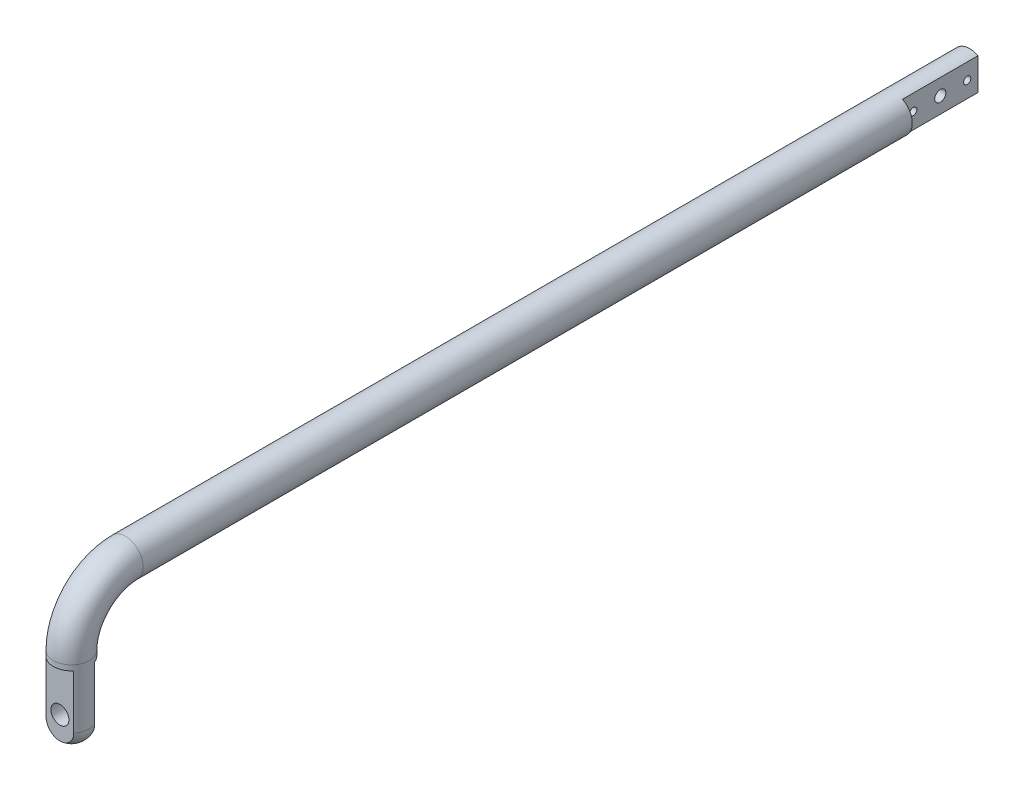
ISO-10303-21;
HEADER;
FILE_DESCRIPTION(('STEP AP214'),'2;1');
FILE_NAME('part.step','',(''),(''),'','','');
FILE_SCHEMA(('AUTOMOTIVE_DESIGN { 1 0 10303 214 1 1 1 1 }'));
ENDSEC;
DATA;
#1=APPLICATION_CONTEXT('core data for automotive mechanical design processes');
#2=APPLICATION_PROTOCOL_DEFINITION('international standard','automotive_design',2000,#1);
#3=PRODUCT_CONTEXT('',#1,'mechanical');
#4=PRODUCT('Part','Part','',(#3));
#5=PRODUCT_RELATED_PRODUCT_CATEGORY('part','',(#4));
#6=PRODUCT_DEFINITION_FORMATION('','',#4);
#7=PRODUCT_DEFINITION_CONTEXT('part definition',#1,'design');
#8=PRODUCT_DEFINITION('design','',#6,#7);
#9=PRODUCT_DEFINITION_SHAPE('','',#8);
#10=(LENGTH_UNIT() NAMED_UNIT(*) SI_UNIT(.MILLI.,.METRE.));
#11=(NAMED_UNIT(*) PLANE_ANGLE_UNIT() SI_UNIT($,.RADIAN.));
#12=(NAMED_UNIT(*) SI_UNIT($,.STERADIAN.) SOLID_ANGLE_UNIT());
#13=UNCERTAINTY_MEASURE_WITH_UNIT(LENGTH_MEASURE(1.E-05),#10,'distance_accuracy_value','');
#14=(GEOMETRIC_REPRESENTATION_CONTEXT(3) GLOBAL_UNCERTAINTY_ASSIGNED_CONTEXT((#13)) GLOBAL_UNIT_ASSIGNED_CONTEXT((#10,
#11,#12)) REPRESENTATION_CONTEXT('',''));
#15=CARTESIAN_POINT('',(0.,0.,0.));
#16=DIRECTION('',(0.,0.,1.));
#17=DIRECTION('',(1.,0.,0.));
#18=AXIS2_PLACEMENT_3D('',#15,#16,#17);
#19=CARTESIAN_POINT('',(0.,-15.0000000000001,250.));
#20=DIRECTION('',(0.,-1.,0.));
#21=DIRECTION('',(0.,0.,-1.));
#22=AXIS2_PLACEMENT_3D('',#19,#20,#21);
#23=CYLINDRICAL_SURFACE('',#22,5.);
#24=DIRECTION('',(0.,-1.,0.));
#25=VECTOR('',#24,1.);
#26=CARTESIAN_POINT('',(3.8418745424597,-15.0000000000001,253.2));
#27=LINE('',#26,#25);
#28=CARTESIAN_POINT('',(3.8418745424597,-31.44,253.2));
#29=VERTEX_POINT('',#28);
#30=CARTESIAN_POINT('',(3.8418745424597,-16.44,253.2));
#31=VERTEX_POINT('',#30);
#32=EDGE_CURVE('E88',#29,#31,#27,.F.);
#33=ORIENTED_EDGE('',*,*,#32,.F.);
#34=CARTESIAN_POINT('',(0.,-31.44,250.));
#35=DIRECTION('',(0.,-1.,0.));
#36=DIRECTION('',(0.,0.,-1.));
#37=AXIS2_PLACEMENT_3D('',#34,#35,#36);
#38=CIRCLE('',#37,5.);
#39=CARTESIAN_POINT('',(4.66476151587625,-31.44,248.2));
#40=VERTEX_POINT('',#39);
#41=EDGE_CURVE('E53',#29,#40,#38,.F.);
#42=ORIENTED_EDGE('',*,*,#41,.T.);
#43=DIRECTION('',(0.,-1.,0.));
#44=VECTOR('',#43,1.);
#45=CARTESIAN_POINT('',(4.66476151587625,-15.0000000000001,248.2));
#46=LINE('',#45,#44);
#47=CARTESIAN_POINT('',(4.66476151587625,-16.44,248.2));
#48=VERTEX_POINT('',#47);
#49=EDGE_CURVE('E103',#48,#40,#46,.T.);
#50=ORIENTED_EDGE('',*,*,#49,.F.);
#51=CARTESIAN_POINT('',(0.,-16.44,250.));
#52=DIRECTION('',(0.,1.,0.));
#53=DIRECTION('',(0.,0.,1.));
#54=AXIS2_PLACEMENT_3D('',#51,#52,#53);
#55=CIRCLE('',#54,5.);
#56=CARTESIAN_POINT('',(-4.66476151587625,-16.44,248.2));
#57=VERTEX_POINT('',#56);
#58=EDGE_CURVE('E219',#57,#48,#55,.F.);
#59=ORIENTED_EDGE('',*,*,#58,.F.);
#60=DIRECTION('',(0.,-1.,0.));
#61=VECTOR('',#60,1.);
#62=CARTESIAN_POINT('',(-4.66476151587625,-15.0000000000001,248.2));
#63=LINE('',#62,#61);
#64=CARTESIAN_POINT('',(-4.66476151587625,-31.44,248.2));
#65=VERTEX_POINT('',#64);
#66=EDGE_CURVE('E105',#65,#57,#63,.F.);
#67=ORIENTED_EDGE('',*,*,#66,.F.);
#68=CARTESIAN_POINT('',(-3.8418745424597,-31.44,253.2));
#69=VERTEX_POINT('',#68);
#70=EDGE_CURVE('E95',#65,#69,#38,.F.);
#71=ORIENTED_EDGE('',*,*,#70,.T.);
#72=DIRECTION('',(0.,-1.,0.));
#73=VECTOR('',#72,1.);
#74=CARTESIAN_POINT('',(-3.8418745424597,-15.0000000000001,253.2));
#75=LINE('',#74,#73);
#76=CARTESIAN_POINT('',(-3.8418745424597,-16.44,253.2));
#77=VERTEX_POINT('',#76);
#78=EDGE_CURVE('E45',#77,#69,#75,.T.);
#79=ORIENTED_EDGE('',*,*,#78,.F.);
#80=CARTESIAN_POINT('',(0.,-16.44,250.));
#81=DIRECTION('',(0.,1.,0.));
#82=DIRECTION('',(0.,0.,1.));
#83=AXIS2_PLACEMENT_3D('',#80,#81,#82);
#84=CIRCLE('',#83,5.);
#85=EDGE_CURVE('E11',#31,#77,#84,.F.);
#86=ORIENTED_EDGE('',*,*,#85,.F.);
#87=EDGE_LOOP('',(#33,#42,#50,#59,#67,#71,#79,#86));
#88=FACE_BOUND('',#87,.T.);
#89=CARTESIAN_POINT('',(0.,-15.0000000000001,250.));
#90=DIRECTION('',(0.,-1.,0.));
#91=DIRECTION('',(1.,0.,0.));
#92=AXIS2_PLACEMENT_3D('',#89,#90,#91);
#93=CIRCLE('',#92,5.);
#94=CARTESIAN_POINT('',(0.,-15.0000000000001,255.));
#95=VERTEX_POINT('',#94);
#96=EDGE_CURVE('E226',#95,#95,#93,.T.);
#97=ORIENTED_EDGE('',*,*,#96,.T.);
#98=EDGE_LOOP('',(#97));
#99=FACE_BOUND('',#98,.T.);
#100=ADVANCED_FACE('F31',(#88,#99),#23,.T.);
#101=CARTESIAN_POINT('',(0.,-15.,235.));
#102=DIRECTION('',(1.,0.,0.));
#103=DIRECTION('',(0.,0.,-1.));
#104=AXIS2_PLACEMENT_3D('',#101,#102,#103);
#105=TOROIDAL_SURFACE('',#104,15.,5.);
#106=CARTESIAN_POINT('',(0.,0.,235.));
#107=DIRECTION('',(0.,0.,1.));
#108=DIRECTION('',(1.,0.,0.));
#109=AXIS2_PLACEMENT_3D('',#106,#107,#108);
#110=CIRCLE('',#109,5.);
#111=CARTESIAN_POINT('',(0.,5.,235.));
#112=VERTEX_POINT('',#111);
#113=EDGE_CURVE('E228',#112,#112,#110,.T.);
#114=CARTESIAN_POINT('',(0.,-15.,235.));
#115=DIRECTION('',(1.,0.,0.));
#116=DIRECTION('',(0.,0.,-1.));
#117=AXIS2_PLACEMENT_3D('',#114,#115,#116);
#118=CIRCLE('',#117,20.);
#119=EDGE_CURVE('',#112,#95,#118,.T.);
#120=ORIENTED_EDGE('',*,*,#113,.T.);
#121=ORIENTED_EDGE('',*,*,#96,.F.);
#122=ORIENTED_EDGE('',*,*,#119,.T.);
#123=ORIENTED_EDGE('',*,*,#119,.F.);
#124=EDGE_LOOP('',(#120,#122,#121,#123));
#125=FACE_BOUND('',#124,.T.);
#126=ADVANCED_FACE('F174',(#125),#105,.T.);
#127=CARTESIAN_POINT('',(0.,0.,235.));
#128=DIRECTION('',(0.,0.,-1.));
#129=DIRECTION('',(-1.,0.,0.));
#130=AXIS2_PLACEMENT_3D('',#127,#128,#129);
#131=CYLINDRICAL_SURFACE('',#130,5.);
#132=CARTESIAN_POINT('',(-5.,0.,8.95));
#133=CARTESIAN_POINT('',(-4.99999951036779,-0.0848984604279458,8.9500006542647));
#134=CARTESIAN_POINT('',(-4.99781721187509,-0.16980366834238,8.95699825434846));
#135=CARTESIAN_POINT('',(-4.98932527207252,-0.337133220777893,8.98473181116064));
#136=CARTESIAN_POINT('',(-4.98301463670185,-0.419556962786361,9.00547107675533));
#137=CARTESIAN_POINT('',(-4.96695583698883,-0.579486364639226,9.05992291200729));
#138=CARTESIAN_POINT('',(-4.95721294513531,-0.656999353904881,9.09361559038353));
#139=CARTESIAN_POINT('',(-4.93529695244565,-0.805275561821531,9.17293382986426));
#140=CARTESIAN_POINT('',(-4.923123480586,-0.876037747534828,9.2185612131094));
#141=CARTESIAN_POINT('',(-4.89722526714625,-1.01095832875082,9.32191625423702));
#142=CARTESIAN_POINT('',(-4.88346713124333,-1.07488231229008,9.37994151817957));
#143=CARTESIAN_POINT('',(-4.85614480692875,-1.19226552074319,9.50581140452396));
#144=CARTESIAN_POINT('',(-4.84258065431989,-1.24572283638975,9.57365781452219));
#145=CARTESIAN_POINT('',(-4.81682477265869,-1.34191867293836,9.71926408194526));
#146=CARTESIAN_POINT('',(-4.8046743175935,-1.38436572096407,9.7972244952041));
#147=CARTESIAN_POINT('',(-4.78362317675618,-1.45544961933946,9.95961468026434));
#148=CARTESIAN_POINT('',(-4.77472165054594,-1.48409004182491,10.0440427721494));
#149=CARTESIAN_POINT('',(-4.76152527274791,-1.52589247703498,10.2143291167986));
#150=CARTESIAN_POINT('',(-4.75710149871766,-1.53948878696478,10.3000704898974));
#151=CARTESIAN_POINT('',(-4.75297857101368,-1.55217372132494,10.4727226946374));
#152=CARTESIAN_POINT('',(-4.75327818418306,-1.55126613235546,10.5596332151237));
#153=CARTESIAN_POINT('',(-4.75845428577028,-1.53530900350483,10.7285765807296));
#154=CARTESIAN_POINT('',(-4.76315261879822,-1.52080991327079,10.8106677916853));
#155=CARTESIAN_POINT('',(-4.77630760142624,-1.47897319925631,10.9711897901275));
#156=CARTESIAN_POINT('',(-4.78476464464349,-1.45163423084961,11.0496201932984));
#157=CARTESIAN_POINT('',(-4.80462183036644,-1.38450171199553,11.2019126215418));
#158=CARTESIAN_POINT('',(-4.81606267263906,-1.34453416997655,11.2756924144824));
#159=CARTESIAN_POINT('',(-4.84057952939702,-1.25339989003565,11.4156794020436));
#160=CARTESIAN_POINT('',(-4.85365596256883,-1.2022302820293,11.4818846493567));
#161=CARTESIAN_POINT('',(-4.88068691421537,-1.08743667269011,11.6079572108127));
#162=CARTESIAN_POINT('',(-4.89465453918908,-1.0233577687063,11.6674082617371));
#163=CARTESIAN_POINT('',(-4.92137742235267,-0.885965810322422,11.7748209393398));
#164=CARTESIAN_POINT('',(-4.93413259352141,-0.812652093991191,11.8227817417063));
#165=CARTESIAN_POINT('',(-4.95712370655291,-0.658078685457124,11.9061285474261));
#166=CARTESIAN_POINT('',(-4.96733986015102,-0.576763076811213,11.9414166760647));
#167=CARTESIAN_POINT('',(-4.98395906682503,-0.408959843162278,11.9976903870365));
#168=CARTESIAN_POINT('',(-4.99036325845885,-0.322473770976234,12.0186802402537));
#169=CARTESIAN_POINT('',(-4.99845438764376,-0.150319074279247,12.0450557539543));
#170=CARTESIAN_POINT('',(-5.00031163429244,-0.0647446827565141,12.0510050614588));
#171=CARTESIAN_POINT('',(-4.99960248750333,0.106188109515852,12.048717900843));
#172=CARTESIAN_POINT('',(-4.99703672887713,0.191546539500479,12.0404834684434));
#173=CARTESIAN_POINT('',(-4.98788169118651,0.35745979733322,12.0105157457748));
#174=CARTESIAN_POINT('',(-4.9813920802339,0.438081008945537,11.989116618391));
#175=CARTESIAN_POINT('',(-4.965146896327,0.594567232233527,11.9338335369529));
#176=CARTESIAN_POINT('',(-4.95539092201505,0.670431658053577,11.8999480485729));
#177=CARTESIAN_POINT('',(-4.93332471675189,0.817286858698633,11.8197389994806));
#178=CARTESIAN_POINT('',(-4.92095852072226,0.888115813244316,11.7731349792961));
#179=CARTESIAN_POINT('',(-4.89508710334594,1.02113752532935,11.669149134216));
#180=CARTESIAN_POINT('',(-4.88158157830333,1.08332796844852,11.6117644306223));
#181=CARTESIAN_POINT('',(-4.85429209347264,1.19982105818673,11.4851955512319));
#182=CARTESIAN_POINT('',(-4.84051777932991,1.25372210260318,11.4156388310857));
#183=CARTESIAN_POINT('',(-4.8148023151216,1.34912131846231,11.2681682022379));
#184=CARTESIAN_POINT('',(-4.80286113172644,1.39061971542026,11.190254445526));
#185=CARTESIAN_POINT('',(-4.78229760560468,1.45977182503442,11.0284613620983));
#186=CARTESIAN_POINT('',(-4.77366186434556,1.48748156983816,10.9446077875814));
#187=CARTESIAN_POINT('',(-4.76075522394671,1.52829209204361,10.7731033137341));
#188=CARTESIAN_POINT('',(-4.75648269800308,1.54139831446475,10.6854538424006));
#189=CARTESIAN_POINT('',(-4.75295389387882,1.55224290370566,10.5130385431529));
#190=CARTESIAN_POINT('',(-4.75348283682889,1.55063923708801,10.4283179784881));
#191=CARTESIAN_POINT('',(-4.75897670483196,1.53369431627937,10.2604160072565));
#192=CARTESIAN_POINT('',(-4.76394142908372,1.51835368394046,10.1772345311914));
#193=CARTESIAN_POINT('',(-4.77759858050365,1.47480761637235,10.015927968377));
#194=CARTESIAN_POINT('',(-4.78623717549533,1.4467876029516,9.93774792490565));
#195=CARTESIAN_POINT('',(-4.80625573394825,1.37882379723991,9.78713630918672));
#196=CARTESIAN_POINT('',(-4.81763624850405,1.33887760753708,9.71470589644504));
#197=CARTESIAN_POINT('',(-4.84240420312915,1.24639244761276,9.57462498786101));
#198=CARTESIAN_POINT('',(-4.85585213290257,1.1934270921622,9.5072667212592));
#199=CARTESIAN_POINT('',(-4.88295838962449,1.07716085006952,9.38218112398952));
#200=CARTESIAN_POINT('',(-4.89661677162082,1.01385721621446,9.32445636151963));
#201=CARTESIAN_POINT('',(-4.92312838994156,0.876277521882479,9.21843192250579));
#202=CARTESIAN_POINT('',(-4.93594196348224,0.80171552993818,9.17049227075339));
#203=CARTESIAN_POINT('',(-4.9588270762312,0.645193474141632,9.08789244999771));
#204=CARTESIAN_POINT('',(-4.96889973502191,0.563236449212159,9.05322685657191));
#205=CARTESIAN_POINT('',(-4.98442975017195,0.401796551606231,9.00079732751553));
#206=CARTESIAN_POINT('',(-4.99021839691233,0.32274401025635,8.98180253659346));
#207=CARTESIAN_POINT('',(-4.99800338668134,0.162462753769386,8.9564047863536));
#208=CARTESIAN_POINT('',(-5.00000046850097,0.0812344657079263,8.94999937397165));
#209=CARTESIAN_POINT('',(-5.,0.,8.95));
#210=B_SPLINE_CURVE_WITH_KNOTS('',3,(#132,#133,#134,#135,#136,#137,#138,#139,#140,#141,#142,
#143,#144,#145,#146,#147,#148,#149,#150,#151,#152,#153,#154,#155,#156,#157,#158,#159,#160,#161,
#162,#163,#164,#165,#166,#167,#168,#169,#170,#171,#172,#173,#174,#175,#176,#177,#178,#179,#180,
#181,#182,#183,#184,#185,#186,#187,#188,#189,#190,#191,#192,#193,#194,#195,#196,#197,#198,#199,
#200,#201,#202,#203,#204,#205,#206,#207,#208,#209),.UNSPECIFIED.,.T.,.F.,(4,2,2,2,2,2,2,2,2,2,2,
2,2,2,2,2,2,2,2,2,2,2,2,2,2,2,2,2,2,2,2,2,2,2,2,2,2,2,4),(0.,0.254396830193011,
0.508854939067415,0.76292385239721,1.01703157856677,1.27811016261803,1.53923632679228,
1.80669687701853,2.07408819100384,2.33354085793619,2.59292578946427,2.84223973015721,
3.09157978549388,3.34451706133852,3.59751921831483,3.86184447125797,4.12618868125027,
4.39253268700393,4.65879710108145,4.91492451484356,5.17101517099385,5.42085927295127,
5.67073408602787,5.92663973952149,6.18261382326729,6.44855856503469,6.71449847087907,
6.97934868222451,7.24410010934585,7.49706915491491,7.75002674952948,7.99939903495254,
8.248821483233,8.5078669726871,8.76698141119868,9.03437391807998,9.30165703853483,
9.54512221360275,9.78853994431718),.UNSPECIFIED.);
#211=CARTESIAN_POINT('',(-5.,0.,8.95));
#212=VERTEX_POINT('',#211);
#213=EDGE_CURVE('E123',#212,#212,#210,.T.);
#214=ORIENTED_EDGE('',*,*,#213,.F.);
#215=EDGE_LOOP('',(#214));
#216=FACE_BOUND('',#215,.T.);
#217=ORIENTED_EDGE('',*,*,#113,.F.);
#218=EDGE_LOOP('',(#217));
#219=FACE_BOUND('',#218,.T.);
#220=CARTESIAN_POINT('',(0.,0.,21.));
#221=DIRECTION('',(0.,0.,1.));
#222=DIRECTION('',(1.,0.,0.));
#223=AXIS2_PLACEMENT_3D('',#220,#221,#222);
#224=CIRCLE('',#223,5.);
#225=CARTESIAN_POINT('',(2.3,-4.43959457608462,21.));
#226=VERTEX_POINT('',#225);
#227=CARTESIAN_POINT('',(2.3,4.43959457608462,21.));
#228=VERTEX_POINT('',#227);
#229=EDGE_CURVE('E207',#226,#228,#224,.T.);
#230=ORIENTED_EDGE('',*,*,#229,.T.);
#231=DIRECTION('',(0.,0.,-1.));
#232=VECTOR('',#231,1.);
#233=CARTESIAN_POINT('',(2.3,4.43959457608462,235.));
#234=LINE('',#233,#232);
#235=CARTESIAN_POINT('',(2.3,4.43959457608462,0.));
#236=VERTEX_POINT('',#235);
#237=EDGE_CURVE('E214',#228,#236,#234,.T.);
#238=ORIENTED_EDGE('',*,*,#237,.T.);
#239=CARTESIAN_POINT('',(0.,0.,0.));
#240=DIRECTION('',(0.,0.,1.));
#241=DIRECTION('',(1.,0.,0.));
#242=AXIS2_PLACEMENT_3D('',#239,#240,#241);
#243=CIRCLE('',#242,5.);
#244=CARTESIAN_POINT('',(2.3,-4.43959457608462,0.));
#245=VERTEX_POINT('',#244);
#246=EDGE_CURVE('E232',#236,#245,#243,.T.);
#247=ORIENTED_EDGE('',*,*,#246,.T.);
#248=DIRECTION('',(0.,0.,-1.));
#249=VECTOR('',#248,1.);
#250=CARTESIAN_POINT('',(2.3,-4.43959457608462,235.));
#251=LINE('',#250,#249);
#252=EDGE_CURVE('E210',#245,#226,#251,.F.);
#253=ORIENTED_EDGE('',*,*,#252,.T.);
#254=EDGE_LOOP('',(#230,#238,#247,#253));
#255=FACE_BOUND('',#254,.T.);
#256=ADVANCED_FACE('F179',(#216,#219,#255),#131,.T.);
#257=CARTESIAN_POINT('',(0.,0.,0.));
#258=DIRECTION('',(0.,0.,1.));
#259=DIRECTION('',(1.,0.,0.));
#260=AXIS2_PLACEMENT_3D('',#257,#258,#259);
#261=PLANE('',#260);
#262=ORIENTED_EDGE('',*,*,#246,.F.);
#263=DIRECTION('',(0.,-1.,0.));
#264=VECTOR('',#263,1.);
#265=CARTESIAN_POINT('',(2.3,0.,0.));
#266=LINE('',#265,#264);
#267=EDGE_CURVE('E217',#236,#245,#266,.T.);
#268=ORIENTED_EDGE('',*,*,#267,.T.);
#269=EDGE_LOOP('',(#262,#268));
#270=FACE_BOUND('',#269,.T.);
#271=ADVANCED_FACE('F185',(#270),#261,.F.);
#272=CARTESIAN_POINT('',(0.,-31.44,250.));
#273=DIRECTION('',(0.,0.,1.));
#274=DIRECTION('',(1.,0.,0.));
#275=AXIS2_PLACEMENT_3D('',#272,#273,#274);
#276=SPHERICAL_SURFACE('',#275,5.);
#277=CARTESIAN_POINT('',(0.,-31.44,253.2));
#278=DIRECTION('',(0.,0.,-1.));
#279=DIRECTION('',(-1.,0.,0.));
#280=AXIS2_PLACEMENT_3D('',#277,#278,#279);
#281=CIRCLE('',#280,3.8418745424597);
#282=EDGE_CURVE('E38',#69,#29,#281,.F.);
#283=ORIENTED_EDGE('',*,*,#282,.F.);
#284=ORIENTED_EDGE('',*,*,#70,.F.);
#285=CARTESIAN_POINT('',(0.,-31.44,248.2));
#286=DIRECTION('',(0.,0.,1.));
#287=DIRECTION('',(1.,0.,0.));
#288=AXIS2_PLACEMENT_3D('',#285,#286,#287);
#289=CIRCLE('',#288,4.66476151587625);
#290=EDGE_CURVE('E216',#40,#65,#289,.F.);
#291=ORIENTED_EDGE('',*,*,#290,.F.);
#292=ORIENTED_EDGE('',*,*,#41,.F.);
#293=EDGE_LOOP('',(#283,#284,#291,#292));
#294=FACE_BOUND('',#293,.T.);
#295=ADVANCED_FACE('F192',(#294),#276,.T.);
#296=CARTESIAN_POINT('',(2.3,-5.,21.));
#297=DIRECTION('',(0.,0.,1.));
#298=DIRECTION('',(1.,0.,0.));
#299=AXIS2_PLACEMENT_3D('',#296,#297,#298);
#300=PLANE('',#299);
#301=DIRECTION('',(0.,1.,0.));
#302=VECTOR('',#301,1.);
#303=CARTESIAN_POINT('',(2.3,-5.,21.));
#304=LINE('',#303,#302);
#305=EDGE_CURVE('E130',#226,#228,#304,.T.);
#306=ORIENTED_EDGE('',*,*,#305,.T.);
#307=ORIENTED_EDGE('',*,*,#229,.F.);
#308=EDGE_LOOP('',(#306,#307));
#309=FACE_BOUND('',#308,.T.);
#310=ADVANCED_FACE('F195',(#309),#300,.F.);
#311=CARTESIAN_POINT('',(2.3,-5.,21.));
#312=DIRECTION('',(-1.,0.,0.));
#313=DIRECTION('',(0.,0.,1.));
#314=AXIS2_PLACEMENT_3D('',#311,#312,#313);
#315=PLANE('',#314);
#316=CARTESIAN_POINT('',(2.3,0.,18.));
#317=DIRECTION('',(1.,0.,0.));
#318=DIRECTION('',(0.,0.,1.));
#319=AXIS2_PLACEMENT_3D('',#316,#317,#318);
#320=CIRCLE('',#319,0.999999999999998);
#321=CARTESIAN_POINT('',(2.3,0.,19.));
#322=VERTEX_POINT('',#321);
#323=EDGE_CURVE('E108',#322,#322,#320,.T.);
#324=ORIENTED_EDGE('',*,*,#323,.F.);
#325=EDGE_LOOP('',(#324));
#326=FACE_BOUND('',#325,.T.);
#327=CARTESIAN_POINT('',(2.3,0.,3.));
#328=DIRECTION('',(1.,0.,0.));
#329=DIRECTION('',(0.,0.,-1.));
#330=AXIS2_PLACEMENT_3D('',#327,#328,#329);
#331=CIRCLE('',#330,1.);
#332=CARTESIAN_POINT('',(2.3,0.,2.));
#333=VERTEX_POINT('',#332);
#334=EDGE_CURVE('E114',#333,#333,#331,.T.);
#335=ORIENTED_EDGE('',*,*,#334,.F.);
#336=EDGE_LOOP('',(#335));
#337=FACE_BOUND('',#336,.T.);
#338=CARTESIAN_POINT('',(2.3,0.,10.5));
#339=DIRECTION('',(1.,0.,0.));
#340=DIRECTION('',(0.,0.,-1.));
#341=AXIS2_PLACEMENT_3D('',#338,#339,#340);
#342=CIRCLE('',#341,1.55);
#343=CARTESIAN_POINT('',(2.3,0.,8.95));
#344=VERTEX_POINT('',#343);
#345=EDGE_CURVE('E120',#344,#344,#342,.T.);
#346=ORIENTED_EDGE('',*,*,#345,.F.);
#347=EDGE_LOOP('',(#346));
#348=FACE_BOUND('',#347,.T.);
#349=ORIENTED_EDGE('',*,*,#305,.F.);
#350=ORIENTED_EDGE('',*,*,#252,.F.);
#351=ORIENTED_EDGE('',*,*,#267,.F.);
#352=ORIENTED_EDGE('',*,*,#237,.F.);
#353=EDGE_LOOP('',(#349,#350,#351,#352));
#354=FACE_BOUND('',#353,.T.);
#355=ADVANCED_FACE('F197',(#326,#337,#348,#354),#315,.F.);
#356=CARTESIAN_POINT('',(-5.001,0.,10.5));
#357=DIRECTION('',(1.,0.,0.));
#358=DIRECTION('',(0.,0.,-1.));
#359=AXIS2_PLACEMENT_3D('',#356,#357,#358);
#360=CYLINDRICAL_SURFACE('',#359,1.55);
#361=ORIENTED_EDGE('',*,*,#345,.T.);
#362=EDGE_LOOP('',(#361));
#363=FACE_BOUND('',#362,.T.);
#364=ORIENTED_EDGE('',*,*,#213,.T.);
#365=EDGE_LOOP('',(#364));
#366=FACE_BOUND('',#365,.T.);
#367=ADVANCED_FACE('F132',(#363,#366),#360,.F.);
#368=CARTESIAN_POINT('',(0.3,0.,3.));
#369=DIRECTION('',(1.,0.,0.));
#370=DIRECTION('',(0.,0.,-1.));
#371=AXIS2_PLACEMENT_3D('',#368,#369,#370);
#372=CYLINDRICAL_SURFACE('',#371,1.);
#373=CARTESIAN_POINT('',(0.3,0.,3.));
#374=DIRECTION('',(1.,0.,0.));
#375=DIRECTION('',(0.,0.,-1.));
#376=AXIS2_PLACEMENT_3D('',#373,#374,#375);
#377=CIRCLE('',#376,1.);
#378=CARTESIAN_POINT('',(0.3,0.,2.));
#379=VERTEX_POINT('',#378);
#380=EDGE_CURVE('E117',#379,#379,#377,.T.);
#381=ORIENTED_EDGE('',*,*,#380,.F.);
#382=EDGE_LOOP('',(#381));
#383=FACE_BOUND('',#382,.T.);
#384=ORIENTED_EDGE('',*,*,#334,.T.);
#385=EDGE_LOOP('',(#384));
#386=FACE_BOUND('',#385,.T.);
#387=ADVANCED_FACE('F137',(#383,#386),#372,.F.);
#388=CARTESIAN_POINT('',(0.3,0.,3.));
#389=DIRECTION('',(1.,0.,0.));
#390=DIRECTION('',(0.,0.,-1.));
#391=AXIS2_PLACEMENT_3D('',#388,#389,#390);
#392=PLANE('',#391);
#393=ORIENTED_EDGE('',*,*,#380,.T.);
#394=EDGE_LOOP('',(#393));
#395=FACE_BOUND('',#394,.T.);
#396=ADVANCED_FACE('F140',(#395),#392,.T.);
#397=CARTESIAN_POINT('',(0.3,0.,18.));
#398=DIRECTION('',(1.,0.,0.));
#399=DIRECTION('',(0.,0.,-1.));
#400=AXIS2_PLACEMENT_3D('',#397,#398,#399);
#401=CYLINDRICAL_SURFACE('',#400,0.999999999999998);
#402=CARTESIAN_POINT('',(0.3,0.,18.));
#403=DIRECTION('',(1.,0.,0.));
#404=DIRECTION('',(0.,0.,1.));
#405=AXIS2_PLACEMENT_3D('',#402,#403,#404);
#406=CIRCLE('',#405,0.999999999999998);
#407=CARTESIAN_POINT('',(0.3,0.,19.));
#408=VERTEX_POINT('',#407);
#409=EDGE_CURVE('E111',#408,#408,#406,.T.);
#410=ORIENTED_EDGE('',*,*,#409,.F.);
#411=EDGE_LOOP('',(#410));
#412=FACE_BOUND('',#411,.T.);
#413=ORIENTED_EDGE('',*,*,#323,.T.);
#414=EDGE_LOOP('',(#413));
#415=FACE_BOUND('',#414,.T.);
#416=ADVANCED_FACE('F144',(#412,#415),#401,.F.);
#417=CARTESIAN_POINT('',(0.3,0.,18.));
#418=DIRECTION('',(-1.,0.,0.));
#419=DIRECTION('',(0.,0.,1.));
#420=AXIS2_PLACEMENT_3D('',#417,#418,#419);
#421=PLANE('',#420);
#422=ORIENTED_EDGE('',*,*,#409,.T.);
#423=EDGE_LOOP('',(#422));
#424=FACE_BOUND('',#423,.T.);
#425=ADVANCED_FACE('F148',(#424),#421,.F.);
#426=CARTESIAN_POINT('',(-5.,-36.44,248.2));
#427=DIRECTION('',(0.,0.,1.));
#428=DIRECTION('',(1.,0.,0.));
#429=AXIS2_PLACEMENT_3D('',#426,#427,#428);
#430=PLANE('',#429);
#431=CARTESIAN_POINT('',(0.,-28.94,248.2));
#432=DIRECTION('',(0.,0.,-1.));
#433=DIRECTION('',(-1.,0.,0.));
#434=AXIS2_PLACEMENT_3D('',#431,#432,#433);
#435=CIRCLE('',#434,2.5);
#436=CARTESIAN_POINT('',(-2.5,-28.94,248.2));
#437=VERTEX_POINT('',#436);
#438=EDGE_CURVE('E311',#437,#437,#435,.T.);
#439=ORIENTED_EDGE('',*,*,#438,.F.);
#440=EDGE_LOOP('',(#439));
#441=FACE_BOUND('',#440,.T.);
#442=ORIENTED_EDGE('',*,*,#66,.T.);
#443=DIRECTION('',(1.,0.,0.));
#444=VECTOR('',#443,1.);
#445=CARTESIAN_POINT('',(-5.,-16.44,248.2));
#446=LINE('',#445,#444);
#447=EDGE_CURVE('E97',#57,#48,#446,.T.);
#448=ORIENTED_EDGE('',*,*,#447,.T.);
#449=ORIENTED_EDGE('',*,*,#49,.T.);
#450=ORIENTED_EDGE('',*,*,#290,.T.);
#451=EDGE_LOOP('',(#442,#448,#449,#450));
#452=FACE_BOUND('',#451,.T.);
#453=ADVANCED_FACE('F152',(#441,#452),#430,.F.);
#454=CARTESIAN_POINT('',(-5.,-16.44,248.2));
#455=DIRECTION('',(0.,1.,0.));
#456=DIRECTION('',(0.,0.,1.));
#457=AXIS2_PLACEMENT_3D('',#454,#455,#456);
#458=PLANE('',#457);
#459=ORIENTED_EDGE('',*,*,#447,.F.);
#460=ORIENTED_EDGE('',*,*,#58,.T.);
#461=EDGE_LOOP('',(#459,#460));
#462=FACE_BOUND('',#461,.T.);
#463=ADVANCED_FACE('F156',(#462),#458,.F.);
#464=CARTESIAN_POINT('',(-5.,-36.44,253.2));
#465=DIRECTION('',(0.,0.,-1.));
#466=DIRECTION('',(-1.,0.,0.));
#467=AXIS2_PLACEMENT_3D('',#464,#465,#466);
#468=PLANE('',#467);
#469=CARTESIAN_POINT('',(0.,-28.94,253.2));
#470=DIRECTION('',(0.,0.,-1.));
#471=DIRECTION('',(-1.,0.,0.));
#472=AXIS2_PLACEMENT_3D('',#469,#470,#471);
#473=CIRCLE('',#472,2.5);
#474=CARTESIAN_POINT('',(-2.5,-28.94,253.2));
#475=VERTEX_POINT('',#474);
#476=EDGE_CURVE('E89',#475,#475,#473,.F.);
#477=ORIENTED_EDGE('',*,*,#476,.F.);
#478=EDGE_LOOP('',(#477));
#479=FACE_BOUND('',#478,.T.);
#480=ORIENTED_EDGE('',*,*,#32,.T.);
#481=DIRECTION('',(1.,0.,0.));
#482=VECTOR('',#481,1.);
#483=CARTESIAN_POINT('',(-5.,-16.44,253.2));
#484=LINE('',#483,#482);
#485=EDGE_CURVE('E86',#77,#31,#484,.T.);
#486=ORIENTED_EDGE('',*,*,#485,.F.);
#487=ORIENTED_EDGE('',*,*,#78,.T.);
#488=ORIENTED_EDGE('',*,*,#282,.T.);
#489=EDGE_LOOP('',(#480,#486,#487,#488));
#490=FACE_BOUND('',#489,.T.);
#491=ADVANCED_FACE('F87',(#479,#490),#468,.F.);
#492=CARTESIAN_POINT('',(-5.,-16.44,253.2));
#493=DIRECTION('',(0.,1.,0.));
#494=DIRECTION('',(0.,0.,1.));
#495=AXIS2_PLACEMENT_3D('',#492,#493,#494);
#496=PLANE('',#495);
#497=ORIENTED_EDGE('',*,*,#85,.T.);
#498=ORIENTED_EDGE('',*,*,#485,.T.);
#499=EDGE_LOOP('',(#497,#498));
#500=FACE_BOUND('',#499,.T.);
#501=ADVANCED_FACE('F85',(#500),#496,.F.);
#502=CARTESIAN_POINT('',(0.,-28.94,255.001));
#503=DIRECTION('',(0.,0.,-1.));
#504=DIRECTION('',(-1.,0.,0.));
#505=AXIS2_PLACEMENT_3D('',#502,#503,#504);
#506=CYLINDRICAL_SURFACE('',#505,2.5);
#507=ORIENTED_EDGE('',*,*,#438,.T.);
#508=EDGE_LOOP('',(#507));
#509=FACE_BOUND('',#508,.T.);
#510=ORIENTED_EDGE('',*,*,#476,.T.);
#511=EDGE_LOOP('',(#510));
#512=FACE_BOUND('',#511,.T.);
#513=ADVANCED_FACE('F166',(#509,#512),#506,.F.);
#514=CLOSED_SHELL('',(#100,#126,#256,#271,#295,#310,#355,#367,#387,#396,#416,#425,#453,#463,
#491,#501,#513));
#515=MANIFOLD_SOLID_BREP('B2',#514);
#516=ADVANCED_BREP_SHAPE_REPRESENTATION('',(#18,#515),#14);
#517=SHAPE_DEFINITION_REPRESENTATION(#9,#516);
ENDSEC;
END-ISO-10303-21;
